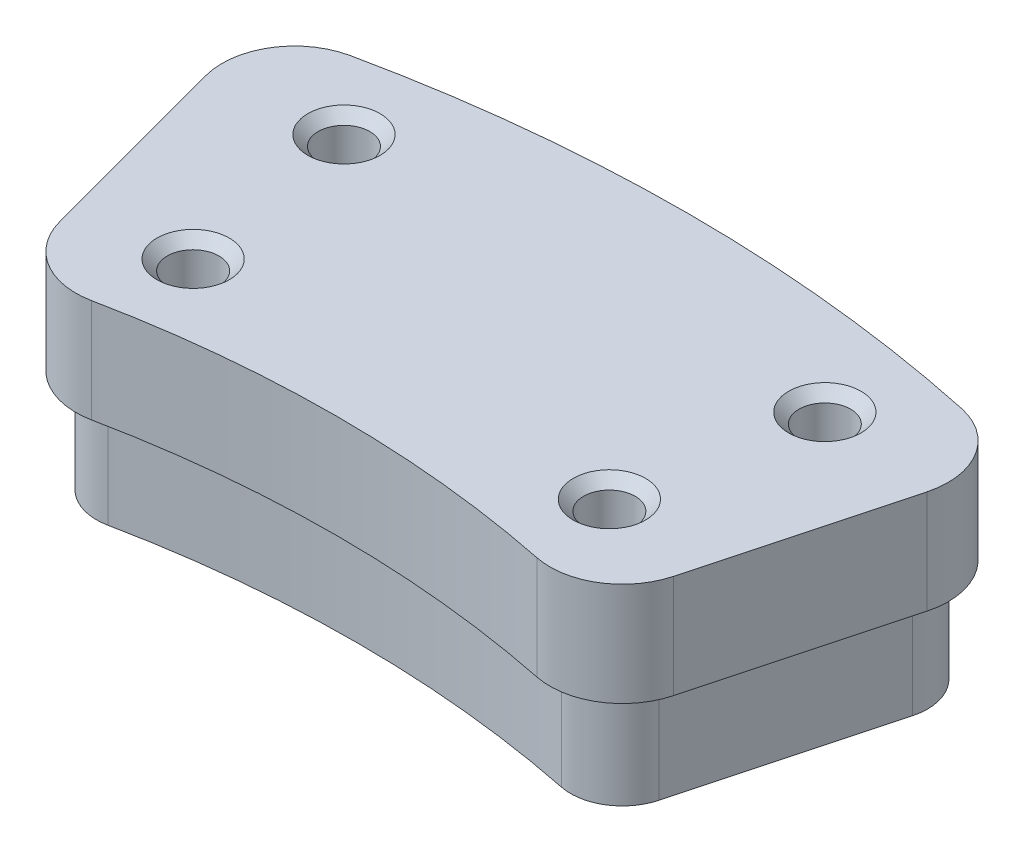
ISO-10303-21;
HEADER;
FILE_DESCRIPTION(('STEP AP214'),'2;1');
FILE_NAME('part.step','',(''),(''),'','','');
FILE_SCHEMA(('AUTOMOTIVE_DESIGN { 1 0 10303 214 1 1 1 1 }'));
ENDSEC;
DATA;
#1=APPLICATION_CONTEXT('core data for automotive mechanical design processes');
#2=APPLICATION_PROTOCOL_DEFINITION('international standard','automotive_design',2000,#1);
#3=PRODUCT_CONTEXT('',#1,'mechanical');
#4=PRODUCT('Part','Part','',(#3));
#5=PRODUCT_RELATED_PRODUCT_CATEGORY('part','',(#4));
#6=PRODUCT_DEFINITION_FORMATION('','',#4);
#7=PRODUCT_DEFINITION_CONTEXT('part definition',#1,'design');
#8=PRODUCT_DEFINITION('design','',#6,#7);
#9=PRODUCT_DEFINITION_SHAPE('','',#8);
#10=(LENGTH_UNIT() NAMED_UNIT(*) SI_UNIT(.MILLI.,.METRE.));
#11=(NAMED_UNIT(*) PLANE_ANGLE_UNIT() SI_UNIT($,.RADIAN.));
#12=(NAMED_UNIT(*) SI_UNIT($,.STERADIAN.) SOLID_ANGLE_UNIT());
#13=UNCERTAINTY_MEASURE_WITH_UNIT(LENGTH_MEASURE(1.E-05),#10,'distance_accuracy_value','');
#14=(GEOMETRIC_REPRESENTATION_CONTEXT(3) GLOBAL_UNCERTAINTY_ASSIGNED_CONTEXT((#13)) GLOBAL_UNIT_ASSIGNED_CONTEXT((#10,
#11,#12)) REPRESENTATION_CONTEXT('',''));
#15=CARTESIAN_POINT('',(0.,0.,0.));
#16=DIRECTION('',(0.,0.,1.));
#17=DIRECTION('',(1.,0.,0.));
#18=AXIS2_PLACEMENT_3D('',#15,#16,#17);
#19=CARTESIAN_POINT('',(0.,20.,0.));
#20=DIRECTION('',(0.,-1.,0.));
#21=DIRECTION('',(0.,0.,-1.));
#22=AXIS2_PLACEMENT_3D('',#19,#20,#21);
#23=CYLINDRICAL_SURFACE('',#22,108.);
#24=CARTESIAN_POINT('',(0.,20.,0.));
#25=DIRECTION('',(0.,-1.,0.));
#26=DIRECTION('',(0.,0.,1.));
#27=AXIS2_PLACEMENT_3D('',#24,#25,#26);
#28=CIRCLE('',#27,108.);
#29=CARTESIAN_POINT('',(-21.5507130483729,20.,-105.828005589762));
#30=VERTEX_POINT('',#29);
#31=CARTESIAN_POINT('',(21.5507130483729,20.,-105.828005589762));
#32=VERTEX_POINT('',#31);
#33=EDGE_CURVE('E238',#30,#32,#28,.T.);
#34=ORIENTED_EDGE('',*,*,#33,.F.);
#35=DIRECTION('',(0.,-1.,0.));
#36=VECTOR('',#35,1.);
#37=CARTESIAN_POINT('',(-21.550713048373,20.,-105.828005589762));
#38=LINE('',#37,#36);
#39=CARTESIAN_POINT('',(-21.5507130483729,10.,-105.828005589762));
#40=VERTEX_POINT('',#39);
#41=EDGE_CURVE('E278',#30,#40,#38,.T.);
#42=ORIENTED_EDGE('',*,*,#41,.T.);
#43=CARTESIAN_POINT('',(0.,10.,0.));
#44=DIRECTION('',(0.,1.,0.));
#45=DIRECTION('',(0.,0.,1.));
#46=AXIS2_PLACEMENT_3D('',#43,#44,#45);
#47=CIRCLE('',#46,108.);
#48=CARTESIAN_POINT('',(21.5507130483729,10.,-105.828005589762));
#49=VERTEX_POINT('',#48);
#50=EDGE_CURVE('E199',#40,#49,#47,.F.);
#51=ORIENTED_EDGE('',*,*,#50,.T.);
#52=DIRECTION('',(0.,-1.,0.));
#53=VECTOR('',#52,1.);
#54=CARTESIAN_POINT('',(21.550713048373,20.,-105.828005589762));
#55=LINE('',#54,#53);
#56=EDGE_CURVE('E276',#49,#32,#55,.F.);
#57=ORIENTED_EDGE('',*,*,#56,.T.);
#58=EDGE_LOOP('',(#34,#42,#51,#57));
#59=FACE_BOUND('',#58,.T.);
#60=ADVANCED_FACE('F38',(#59),#23,.F.);
#61=CARTESIAN_POINT('',(27.9524568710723,20.,-104.319989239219));
#62=DIRECTION('',(-0.965925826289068,0.,-0.258819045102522));
#63=DIRECTION('',(-0.258819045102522,0.,0.965925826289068));
#64=AXIS2_PLACEMENT_3D('',#61,#62,#63);
#65=PLANE('',#64);
#66=DIRECTION('',(0.258819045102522,0.,-0.965925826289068));
#67=VECTOR('',#66,1.);
#68=CARTESIAN_POINT('',(27.9524568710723,20.,-104.319989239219));
#69=LINE('',#68,#67);
#70=CARTESIAN_POINT('',(29.7089993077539,20.,-110.875494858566));
#71=VERTEX_POINT('',#70);
#72=CARTESIAN_POINT('',(34.8935686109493,20.,-130.224570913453));
#73=VERTEX_POINT('',#72);
#74=EDGE_CURVE('E241',#71,#73,#69,.T.);
#75=ORIENTED_EDGE('',*,*,#74,.F.);
#76=DIRECTION('',(0.,-1.,0.));
#77=VECTOR('',#76,1.);
#78=CARTESIAN_POINT('',(29.7089993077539,20.,-110.875494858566));
#79=LINE('',#78,#77);
#80=CARTESIAN_POINT('',(29.7089993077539,10.,-110.875494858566));
#81=VERTEX_POINT('',#80);
#82=EDGE_CURVE('E12',#71,#81,#79,.T.);
#83=ORIENTED_EDGE('',*,*,#82,.T.);
#84=DIRECTION('',(0.258819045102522,0.,-0.965925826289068));
#85=VECTOR('',#84,1.);
#86=CARTESIAN_POINT('',(27.9524568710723,10.,-104.319989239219));
#87=LINE('',#86,#85);
#88=CARTESIAN_POINT('',(34.8935686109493,10.,-130.224570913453));
#89=VERTEX_POINT('',#88);
#90=EDGE_CURVE('E196',#81,#89,#87,.T.);
#91=ORIENTED_EDGE('',*,*,#90,.T.);
#92=DIRECTION('',(0.,-1.,0.));
#93=VECTOR('',#92,1.);
#94=CARTESIAN_POINT('',(34.8935686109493,20.,-130.224570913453));
#95=LINE('',#94,#93);
#96=EDGE_CURVE('E46',#89,#73,#95,.F.);
#97=ORIENTED_EDGE('',*,*,#96,.T.);
#98=EDGE_LOOP('',(#75,#83,#91,#97));
#99=FACE_BOUND('',#98,.T.);
#100=ADVANCED_FACE('F307',(#99),#65,.F.);
#101=CARTESIAN_POINT('',(0.,20.,0.));
#102=DIRECTION('',(0.,-1.,0.));
#103=DIRECTION('',(0.,0.,-1.));
#104=AXIS2_PLACEMENT_3D('',#101,#102,#103);
#105=CYLINDRICAL_SURFACE('',#104,142.);
#106=CARTESIAN_POINT('',(0.,10.,0.));
#107=DIRECTION('',(0.,1.,0.));
#108=DIRECTION('',(0.,0.,1.));
#109=AXIS2_PLACEMENT_3D('',#106,#107,#108);
#110=CIRCLE('',#109,142.);
#111=CARTESIAN_POINT('',(29.5907886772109,10.,-138.882631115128));
#112=VERTEX_POINT('',#111);
#113=CARTESIAN_POINT('',(-29.5907886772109,10.,-138.882631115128));
#114=VERTEX_POINT('',#113);
#115=EDGE_CURVE('E194',#112,#114,#110,.T.);
#116=ORIENTED_EDGE('',*,*,#115,.T.);
#117=DIRECTION('',(0.,-1.,0.));
#118=VECTOR('',#117,1.);
#119=CARTESIAN_POINT('',(-29.5907886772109,20.,-138.882631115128));
#120=LINE('',#119,#118);
#121=CARTESIAN_POINT('',(-29.5907886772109,20.,-138.882631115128));
#122=VERTEX_POINT('',#121);
#123=EDGE_CURVE('E53',#114,#122,#120,.F.);
#124=ORIENTED_EDGE('',*,*,#123,.T.);
#125=CARTESIAN_POINT('',(0.,20.,0.));
#126=DIRECTION('',(0.,1.,0.));
#127=DIRECTION('',(0.,0.,1.));
#128=AXIS2_PLACEMENT_3D('',#125,#126,#127);
#129=CIRCLE('',#128,142.);
#130=CARTESIAN_POINT('',(29.5907886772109,20.,-138.882631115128));
#131=VERTEX_POINT('',#130);
#132=EDGE_CURVE('E243',#131,#122,#129,.T.);
#133=ORIENTED_EDGE('',*,*,#132,.F.);
#134=DIRECTION('',(0.,-1.,0.));
#135=VECTOR('',#134,1.);
#136=CARTESIAN_POINT('',(29.5907886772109,20.,-138.882631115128));
#137=LINE('',#136,#135);
#138=EDGE_CURVE('E301',#131,#112,#137,.T.);
#139=ORIENTED_EDGE('',*,*,#138,.T.);
#140=EDGE_LOOP('',(#116,#124,#133,#139));
#141=FACE_BOUND('',#140,.T.);
#142=ADVANCED_FACE('F315',(#141),#105,.T.);
#143=CARTESIAN_POINT('',(-27.9524568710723,20.,-104.319989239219));
#144=DIRECTION('',(0.965925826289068,0.,-0.258819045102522));
#145=DIRECTION('',(-0.258819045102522,0.,-0.965925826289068));
#146=AXIS2_PLACEMENT_3D('',#143,#144,#145);
#147=PLANE('',#146);
#148=DIRECTION('',(0.258819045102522,0.,0.965925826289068));
#149=VECTOR('',#148,1.);
#150=CARTESIAN_POINT('',(-27.9524568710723,10.,-104.319989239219));
#151=LINE('',#150,#149);
#152=CARTESIAN_POINT('',(-34.8935686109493,10.,-130.224570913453));
#153=VERTEX_POINT('',#152);
#154=CARTESIAN_POINT('',(-29.7089993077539,10.,-110.875494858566));
#155=VERTEX_POINT('',#154);
#156=EDGE_CURVE('E248',#153,#155,#151,.T.);
#157=ORIENTED_EDGE('',*,*,#156,.T.);
#158=DIRECTION('',(0.,-1.,0.));
#159=VECTOR('',#158,1.);
#160=CARTESIAN_POINT('',(-29.7089993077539,20.,-110.875494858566));
#161=LINE('',#160,#159);
#162=CARTESIAN_POINT('',(-29.7089993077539,20.,-110.875494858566));
#163=VERTEX_POINT('',#162);
#164=EDGE_CURVE('E292',#155,#163,#161,.F.);
#165=ORIENTED_EDGE('',*,*,#164,.T.);
#166=DIRECTION('',(0.258819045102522,0.,0.965925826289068));
#167=VECTOR('',#166,1.);
#168=CARTESIAN_POINT('',(-27.9524568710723,20.,-104.319989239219));
#169=LINE('',#168,#167);
#170=CARTESIAN_POINT('',(-34.8935686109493,20.,-130.224570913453));
#171=VERTEX_POINT('',#170);
#172=EDGE_CURVE('E245',#171,#163,#169,.T.);
#173=ORIENTED_EDGE('',*,*,#172,.F.);
#174=DIRECTION('',(0.,-1.,0.));
#175=VECTOR('',#174,1.);
#176=CARTESIAN_POINT('',(-34.8935686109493,20.,-130.224570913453));
#177=LINE('',#176,#175);
#178=EDGE_CURVE('E289',#171,#153,#177,.T.);
#179=ORIENTED_EDGE('',*,*,#178,.T.);
#180=EDGE_LOOP('',(#157,#165,#173,#179));
#181=FACE_BOUND('',#180,.T.);
#182=ADVANCED_FACE('F326',(#181),#147,.F.);
#183=CARTESIAN_POINT('',(0.,20.,0.));
#184=DIRECTION('',(0.,1.,0.));
#185=DIRECTION('',(0.,0.,1.));
#186=AXIS2_PLACEMENT_3D('',#183,#184,#185);
#187=PLANE('',#186);
#188=CARTESIAN_POINT('',(-20.143188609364,20.,-114.237699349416));
#189=DIRECTION('',(0.,1.,0.));
#190=DIRECTION('',(0.,0.,1.));
#191=AXIS2_PLACEMENT_3D('',#188,#189,#190);
#192=CIRCLE('',#191,3.5);
#193=CARTESIAN_POINT('',(-20.143188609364,20.,-110.737699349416));
#194=VERTEX_POINT('',#193);
#195=EDGE_CURVE('E202',#194,#194,#192,.T.);
#196=ORIENTED_EDGE('',*,*,#195,.F.);
#197=EDGE_LOOP('',(#196));
#198=FACE_BOUND('',#197,.T.);
#199=CARTESIAN_POINT('',(20.143188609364,20.,-114.237699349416));
#200=DIRECTION('',(0.,1.,0.));
#201=DIRECTION('',(0.,0.,1.));
#202=AXIS2_PLACEMENT_3D('',#199,#200,#201);
#203=CIRCLE('',#202,3.5);
#204=CARTESIAN_POINT('',(20.143188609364,20.,-110.737699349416));
#205=VERTEX_POINT('',#204);
#206=EDGE_CURVE('E211',#205,#205,#203,.T.);
#207=ORIENTED_EDGE('',*,*,#206,.F.);
#208=EDGE_LOOP('',(#207));
#209=FACE_BOUND('',#208,.T.);
#210=CARTESIAN_POINT('',(23.2688558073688,20.,-131.964238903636));
#211=DIRECTION('',(0.,1.,0.));
#212=DIRECTION('',(0.,0.,1.));
#213=AXIS2_PLACEMENT_3D('',#210,#211,#212);
#214=CIRCLE('',#213,3.5);
#215=CARTESIAN_POINT('',(23.2688558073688,20.,-128.464238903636));
#216=VERTEX_POINT('',#215);
#217=EDGE_CURVE('E220',#216,#216,#214,.T.);
#218=ORIENTED_EDGE('',*,*,#217,.F.);
#219=EDGE_LOOP('',(#218));
#220=FACE_BOUND('',#219,.T.);
#221=CARTESIAN_POINT('',(-23.2688558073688,20.,-131.964238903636));
#222=DIRECTION('',(0.,1.,0.));
#223=DIRECTION('',(0.,0.,1.));
#224=AXIS2_PLACEMENT_3D('',#221,#222,#223);
#225=CIRCLE('',#224,3.5);
#226=CARTESIAN_POINT('',(-23.2688558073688,20.,-128.464238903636));
#227=VERTEX_POINT('',#226);
#228=EDGE_CURVE('E229',#227,#227,#225,.T.);
#229=ORIENTED_EDGE('',*,*,#228,.F.);
#230=EDGE_LOOP('',(#229));
#231=FACE_BOUND('',#230,.T.);
#232=ORIENTED_EDGE('',*,*,#172,.T.);
#233=CARTESIAN_POINT('',(-22.9475185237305,20.,-112.687228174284));
#234=DIRECTION('',(0.,1.,0.));
#235=DIRECTION('',(0.,0.,1.));
#236=AXIS2_PLACEMENT_3D('',#233,#234,#235);
#237=CIRCLE('',#236,7.);
#238=EDGE_CURVE('E299',#163,#30,#237,.T.);
#239=ORIENTED_EDGE('',*,*,#238,.T.);
#240=ORIENTED_EDGE('',*,*,#33,.T.);
#241=CARTESIAN_POINT('',(22.9475185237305,20.,-112.687228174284));
#242=DIRECTION('',(0.,1.,0.));
#243=DIRECTION('',(0.,0.,1.));
#244=AXIS2_PLACEMENT_3D('',#241,#242,#243);
#245=CIRCLE('',#244,7.);
#246=EDGE_CURVE('E295',#32,#71,#245,.T.);
#247=ORIENTED_EDGE('',*,*,#246,.T.);
#248=ORIENTED_EDGE('',*,*,#74,.T.);
#249=CARTESIAN_POINT('',(28.1320878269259,20.,-132.036304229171));
#250=DIRECTION('',(0.,1.,0.));
#251=DIRECTION('',(0.,0.,1.));
#252=AXIS2_PLACEMENT_3D('',#249,#250,#251);
#253=CIRCLE('',#252,7.);
#254=EDGE_CURVE('E60',#73,#131,#253,.T.);
#255=ORIENTED_EDGE('',*,*,#254,.T.);
#256=ORIENTED_EDGE('',*,*,#132,.T.);
#257=CARTESIAN_POINT('',(-28.1320878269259,20.,-132.036304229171));
#258=DIRECTION('',(0.,1.,0.));
#259=DIRECTION('',(0.,0.,1.));
#260=AXIS2_PLACEMENT_3D('',#257,#258,#259);
#261=CIRCLE('',#260,7.);
#262=EDGE_CURVE('E297',#122,#171,#261,.T.);
#263=ORIENTED_EDGE('',*,*,#262,.T.);
#264=EDGE_LOOP('',(#232,#239,#240,#247,#248,#255,#256,#263));
#265=FACE_BOUND('',#264,.T.);
#266=ADVANCED_FACE('F311',(#198,#209,#220,#231,#265),#187,.T.);
#267=CARTESIAN_POINT('',(0.,0.,0.));
#268=DIRECTION('',(0.,1.,0.));
#269=DIRECTION('',(0.,0.,1.));
#270=AXIS2_PLACEMENT_3D('',#267,#268,#269);
#271=PLANE('',#270);
#272=CARTESIAN_POINT('',(0.,0.,0.));
#273=DIRECTION('',(0.,-1.,0.));
#274=DIRECTION('',(0.,0.,1.));
#275=AXIS2_PLACEMENT_3D('',#272,#273,#274);
#276=CIRCLE('',#275,110.);
#277=CARTESIAN_POINT('',(-21.9498003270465,0.,-107.787783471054));
#278=VERTEX_POINT('',#277);
#279=CARTESIAN_POINT('',(21.9498003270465,0.,-107.787783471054));
#280=VERTEX_POINT('',#279);
#281=EDGE_CURVE('E170',#278,#280,#276,.T.);
#282=ORIENTED_EDGE('',*,*,#281,.F.);
#283=CARTESIAN_POINT('',(-22.9475185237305,0.,-112.687228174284));
#284=DIRECTION('',(0.,1.,0.));
#285=DIRECTION('',(0.,0.,1.));
#286=AXIS2_PLACEMENT_3D('',#283,#284,#285);
#287=CIRCLE('',#286,5.);
#288=CARTESIAN_POINT('',(-27.7771476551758,0.,-111.393132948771));
#289=VERTEX_POINT('',#288);
#290=EDGE_CURVE('E153',#278,#289,#287,.F.);
#291=ORIENTED_EDGE('',*,*,#290,.T.);
#292=DIRECTION('',(0.258819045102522,0.,0.965925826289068));
#293=VECTOR('',#292,1.);
#294=CARTESIAN_POINT('',(-34.299117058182,0.,-135.7334541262));
#295=LINE('',#294,#293);
#296=CARTESIAN_POINT('',(-32.9617169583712,0.,-130.742209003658));
#297=VERTEX_POINT('',#296);
#298=EDGE_CURVE('E192',#297,#289,#295,.T.);
#299=ORIENTED_EDGE('',*,*,#298,.F.);
#300=CARTESIAN_POINT('',(-28.1320878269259,0.,-132.036304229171));
#301=DIRECTION('',(0.,1.,0.));
#302=DIRECTION('',(0.,0.,1.));
#303=AXIS2_PLACEMENT_3D('',#300,#301,#302);
#304=CIRCLE('',#303,5.);
#305=CARTESIAN_POINT('',(-29.1740170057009,0.,-136.92653771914));
#306=VERTEX_POINT('',#305);
#307=EDGE_CURVE('E164',#297,#306,#304,.F.);
#308=ORIENTED_EDGE('',*,*,#307,.T.);
#309=CARTESIAN_POINT('',(0.,0.,0.));
#310=DIRECTION('',(0.,1.,0.));
#311=DIRECTION('',(0.,0.,1.));
#312=AXIS2_PLACEMENT_3D('',#309,#310,#311);
#313=CIRCLE('',#312,140.);
#314=CARTESIAN_POINT('',(29.1740170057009,0.,-136.92653771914));
#315=VERTEX_POINT('',#314);
#316=EDGE_CURVE('E184',#315,#306,#313,.T.);
#317=ORIENTED_EDGE('',*,*,#316,.F.);
#318=CARTESIAN_POINT('',(28.1320878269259,0.,-132.036304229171));
#319=DIRECTION('',(0.,1.,0.));
#320=DIRECTION('',(0.,0.,1.));
#321=AXIS2_PLACEMENT_3D('',#318,#319,#320);
#322=CIRCLE('',#321,5.);
#323=CARTESIAN_POINT('',(32.9617169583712,0.,-130.742209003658));
#324=VERTEX_POINT('',#323);
#325=EDGE_CURVE('E174',#315,#324,#322,.F.);
#326=ORIENTED_EDGE('',*,*,#325,.T.);
#327=DIRECTION('',(0.258819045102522,0.,-0.965925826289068));
#328=VECTOR('',#327,1.);
#329=CARTESIAN_POINT('',(26.5335371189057,0.,-106.751915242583));
#330=LINE('',#329,#328);
#331=CARTESIAN_POINT('',(27.7771476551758,0.,-111.393132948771));
#332=VERTEX_POINT('',#331);
#333=EDGE_CURVE('E181',#332,#324,#330,.T.);
#334=ORIENTED_EDGE('',*,*,#333,.F.);
#335=CARTESIAN_POINT('',(22.9475185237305,0.,-112.687228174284));
#336=DIRECTION('',(0.,1.,0.));
#337=DIRECTION('',(0.,0.,1.));
#338=AXIS2_PLACEMENT_3D('',#335,#336,#337);
#339=CIRCLE('',#338,5.);
#340=EDGE_CURVE('E180',#332,#280,#339,.F.);
#341=ORIENTED_EDGE('',*,*,#340,.T.);
#342=EDGE_LOOP('',(#282,#291,#299,#308,#317,#326,#334,#341));
#343=FACE_BOUND('',#342,.T.);
#344=CARTESIAN_POINT('',(-20.143188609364,0.,-114.237699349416));
#345=DIRECTION('',(0.,1.,0.));
#346=DIRECTION('',(0.,0.,1.));
#347=AXIS2_PLACEMENT_3D('',#344,#345,#346);
#348=CIRCLE('',#347,2.5);
#349=CARTESIAN_POINT('',(-20.143188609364,0.,-111.737699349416));
#350=VERTEX_POINT('',#349);
#351=EDGE_CURVE('E208',#350,#350,#348,.T.);
#352=ORIENTED_EDGE('',*,*,#351,.T.);
#353=EDGE_LOOP('',(#352));
#354=FACE_BOUND('',#353,.T.);
#355=CARTESIAN_POINT('',(20.143188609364,0.,-114.237699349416));
#356=DIRECTION('',(0.,1.,0.));
#357=DIRECTION('',(0.,0.,1.));
#358=AXIS2_PLACEMENT_3D('',#355,#356,#357);
#359=CIRCLE('',#358,2.5);
#360=CARTESIAN_POINT('',(20.143188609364,0.,-111.737699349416));
#361=VERTEX_POINT('',#360);
#362=EDGE_CURVE('E217',#361,#361,#359,.T.);
#363=ORIENTED_EDGE('',*,*,#362,.T.);
#364=EDGE_LOOP('',(#363));
#365=FACE_BOUND('',#364,.T.);
#366=CARTESIAN_POINT('',(23.2688558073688,0.,-131.964238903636));
#367=DIRECTION('',(0.,1.,0.));
#368=DIRECTION('',(0.,0.,1.));
#369=AXIS2_PLACEMENT_3D('',#366,#367,#368);
#370=CIRCLE('',#369,2.5);
#371=CARTESIAN_POINT('',(23.2688558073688,0.,-129.464238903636));
#372=VERTEX_POINT('',#371);
#373=EDGE_CURVE('E226',#372,#372,#370,.T.);
#374=ORIENTED_EDGE('',*,*,#373,.T.);
#375=EDGE_LOOP('',(#374));
#376=FACE_BOUND('',#375,.T.);
#377=CARTESIAN_POINT('',(-23.2688558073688,0.,-131.964238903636));
#378=DIRECTION('',(0.,1.,0.));
#379=DIRECTION('',(0.,0.,1.));
#380=AXIS2_PLACEMENT_3D('',#377,#378,#379);
#381=CIRCLE('',#380,2.5);
#382=CARTESIAN_POINT('',(-23.2688558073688,0.,-129.464238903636));
#383=VERTEX_POINT('',#382);
#384=EDGE_CURVE('E235',#383,#383,#381,.T.);
#385=ORIENTED_EDGE('',*,*,#384,.T.);
#386=EDGE_LOOP('',(#385));
#387=FACE_BOUND('',#386,.T.);
#388=ADVANCED_FACE('F177',(#343,#354,#365,#376,#387),#271,.F.);
#389=CARTESIAN_POINT('',(-23.2688558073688,20.,-131.964238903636));
#390=DIRECTION('',(0.,1.,0.));
#391=DIRECTION('',(0.,0.,1.));
#392=AXIS2_PLACEMENT_3D('',#389,#390,#391);
#393=CYLINDRICAL_SURFACE('',#392,2.5);
#394=ORIENTED_EDGE('',*,*,#384,.F.);
#395=EDGE_LOOP('',(#394));
#396=FACE_BOUND('',#395,.T.);
#397=CARTESIAN_POINT('',(-23.2688558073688,19.,-131.964238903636));
#398=DIRECTION('',(0.,1.,0.));
#399=DIRECTION('',(0.,0.,1.));
#400=AXIS2_PLACEMENT_3D('',#397,#398,#399);
#401=CIRCLE('',#400,2.5);
#402=CARTESIAN_POINT('',(-23.2688558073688,19.,-129.464238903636));
#403=VERTEX_POINT('',#402);
#404=EDGE_CURVE('E232',#403,#403,#401,.T.);
#405=ORIENTED_EDGE('',*,*,#404,.T.);
#406=EDGE_LOOP('',(#405));
#407=FACE_BOUND('',#406,.T.);
#408=ADVANCED_FACE('F517',(#396,#407),#393,.F.);
#409=CARTESIAN_POINT('',(-23.2688558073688,20.,-131.964238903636));
#410=DIRECTION('',(0.,1.,0.));
#411=DIRECTION('',(0.,0.,1.));
#412=AXIS2_PLACEMENT_3D('',#409,#410,#411);
#413=CONICAL_SURFACE('',#412,3.5,0.785398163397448);
#414=ORIENTED_EDGE('',*,*,#404,.F.);
#415=EDGE_LOOP('',(#414));
#416=FACE_BOUND('',#415,.T.);
#417=ORIENTED_EDGE('',*,*,#228,.T.);
#418=EDGE_LOOP('',(#417));
#419=FACE_BOUND('',#418,.T.);
#420=ADVANCED_FACE('F507',(#416,#419),#413,.F.);
#421=CARTESIAN_POINT('',(23.2688558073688,20.,-131.964238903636));
#422=DIRECTION('',(0.,1.,0.));
#423=DIRECTION('',(0.,0.,1.));
#424=AXIS2_PLACEMENT_3D('',#421,#422,#423);
#425=CYLINDRICAL_SURFACE('',#424,2.5);
#426=ORIENTED_EDGE('',*,*,#373,.F.);
#427=EDGE_LOOP('',(#426));
#428=FACE_BOUND('',#427,.T.);
#429=CARTESIAN_POINT('',(23.2688558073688,19.,-131.964238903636));
#430=DIRECTION('',(0.,1.,0.));
#431=DIRECTION('',(0.,0.,1.));
#432=AXIS2_PLACEMENT_3D('',#429,#430,#431);
#433=CIRCLE('',#432,2.5);
#434=CARTESIAN_POINT('',(23.2688558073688,19.,-129.464238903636));
#435=VERTEX_POINT('',#434);
#436=EDGE_CURVE('E223',#435,#435,#433,.T.);
#437=ORIENTED_EDGE('',*,*,#436,.T.);
#438=EDGE_LOOP('',(#437));
#439=FACE_BOUND('',#438,.T.);
#440=ADVANCED_FACE('F498',(#428,#439),#425,.F.);
#441=CARTESIAN_POINT('',(23.2688558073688,20.,-131.964238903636));
#442=DIRECTION('',(0.,1.,0.));
#443=DIRECTION('',(0.,0.,1.));
#444=AXIS2_PLACEMENT_3D('',#441,#442,#443);
#445=CONICAL_SURFACE('',#444,3.5,0.785398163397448);
#446=ORIENTED_EDGE('',*,*,#436,.F.);
#447=EDGE_LOOP('',(#446));
#448=FACE_BOUND('',#447,.T.);
#449=ORIENTED_EDGE('',*,*,#217,.T.);
#450=EDGE_LOOP('',(#449));
#451=FACE_BOUND('',#450,.T.);
#452=ADVANCED_FACE('F488',(#448,#451),#445,.F.);
#453=CARTESIAN_POINT('',(20.143188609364,20.,-114.237699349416));
#454=DIRECTION('',(0.,1.,0.));
#455=DIRECTION('',(0.,0.,1.));
#456=AXIS2_PLACEMENT_3D('',#453,#454,#455);
#457=CYLINDRICAL_SURFACE('',#456,2.5);
#458=ORIENTED_EDGE('',*,*,#362,.F.);
#459=EDGE_LOOP('',(#458));
#460=FACE_BOUND('',#459,.T.);
#461=CARTESIAN_POINT('',(20.143188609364,19.,-114.237699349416));
#462=DIRECTION('',(0.,1.,0.));
#463=DIRECTION('',(0.,0.,1.));
#464=AXIS2_PLACEMENT_3D('',#461,#462,#463);
#465=CIRCLE('',#464,2.5);
#466=CARTESIAN_POINT('',(20.143188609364,19.,-111.737699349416));
#467=VERTEX_POINT('',#466);
#468=EDGE_CURVE('E214',#467,#467,#465,.T.);
#469=ORIENTED_EDGE('',*,*,#468,.T.);
#470=EDGE_LOOP('',(#469));
#471=FACE_BOUND('',#470,.T.);
#472=ADVANCED_FACE('F479',(#460,#471),#457,.F.);
#473=CARTESIAN_POINT('',(20.143188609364,20.,-114.237699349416));
#474=DIRECTION('',(0.,1.,0.));
#475=DIRECTION('',(0.,0.,1.));
#476=AXIS2_PLACEMENT_3D('',#473,#474,#475);
#477=CONICAL_SURFACE('',#476,3.5,0.785398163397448);
#478=ORIENTED_EDGE('',*,*,#468,.F.);
#479=EDGE_LOOP('',(#478));
#480=FACE_BOUND('',#479,.T.);
#481=ORIENTED_EDGE('',*,*,#206,.T.);
#482=EDGE_LOOP('',(#481));
#483=FACE_BOUND('',#482,.T.);
#484=ADVANCED_FACE('F469',(#480,#483),#477,.F.);
#485=CARTESIAN_POINT('',(-20.143188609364,20.,-114.237699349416));
#486=DIRECTION('',(0.,1.,0.));
#487=DIRECTION('',(0.,0.,1.));
#488=AXIS2_PLACEMENT_3D('',#485,#486,#487);
#489=CYLINDRICAL_SURFACE('',#488,2.5);
#490=ORIENTED_EDGE('',*,*,#351,.F.);
#491=EDGE_LOOP('',(#490));
#492=FACE_BOUND('',#491,.T.);
#493=CARTESIAN_POINT('',(-20.143188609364,19.,-114.237699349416));
#494=DIRECTION('',(0.,1.,0.));
#495=DIRECTION('',(0.,0.,1.));
#496=AXIS2_PLACEMENT_3D('',#493,#494,#495);
#497=CIRCLE('',#496,2.5);
#498=CARTESIAN_POINT('',(-20.143188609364,19.,-111.737699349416));
#499=VERTEX_POINT('',#498);
#500=EDGE_CURVE('E205',#499,#499,#497,.T.);
#501=ORIENTED_EDGE('',*,*,#500,.T.);
#502=EDGE_LOOP('',(#501));
#503=FACE_BOUND('',#502,.T.);
#504=ADVANCED_FACE('F460',(#492,#503),#489,.F.);
#505=CARTESIAN_POINT('',(-20.143188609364,20.,-114.237699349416));
#506=DIRECTION('',(0.,1.,0.));
#507=DIRECTION('',(0.,0.,1.));
#508=AXIS2_PLACEMENT_3D('',#505,#506,#507);
#509=CONICAL_SURFACE('',#508,3.5,0.785398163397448);
#510=ORIENTED_EDGE('',*,*,#500,.F.);
#511=EDGE_LOOP('',(#510));
#512=FACE_BOUND('',#511,.T.);
#513=ORIENTED_EDGE('',*,*,#195,.T.);
#514=EDGE_LOOP('',(#513));
#515=FACE_BOUND('',#514,.T.);
#516=ADVANCED_FACE('F450',(#512,#515),#509,.F.);
#517=CARTESIAN_POINT('',(0.,10.,-123.15999461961));
#518=DIRECTION('',(0.,1.,0.));
#519=DIRECTION('',(0.,0.,1.));
#520=AXIS2_PLACEMENT_3D('',#517,#518,#519);
#521=PLANE('',#520);
#522=CARTESIAN_POINT('',(0.,10.,0.));
#523=DIRECTION('',(0.,-1.,0.));
#524=DIRECTION('',(0.,0.,1.));
#525=AXIS2_PLACEMENT_3D('',#522,#523,#524);
#526=CIRCLE('',#525,110.);
#527=CARTESIAN_POINT('',(-21.9498003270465,10.,-107.787783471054));
#528=VERTEX_POINT('',#527);
#529=CARTESIAN_POINT('',(21.9498003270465,10.,-107.787783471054));
#530=VERTEX_POINT('',#529);
#531=EDGE_CURVE('E173',#528,#530,#526,.T.);
#532=ORIENTED_EDGE('',*,*,#531,.T.);
#533=CARTESIAN_POINT('',(22.9475185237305,10.,-112.687228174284));
#534=DIRECTION('',(0.,1.,0.));
#535=DIRECTION('',(0.,0.,1.));
#536=AXIS2_PLACEMENT_3D('',#533,#534,#535);
#537=CIRCLE('',#536,5.);
#538=CARTESIAN_POINT('',(27.7771476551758,10.,-111.393132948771));
#539=VERTEX_POINT('',#538);
#540=EDGE_CURVE('E272',#530,#539,#537,.T.);
#541=ORIENTED_EDGE('',*,*,#540,.T.);
#542=DIRECTION('',(0.258819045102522,0.,-0.965925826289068));
#543=VECTOR('',#542,1.);
#544=CARTESIAN_POINT('',(26.5335371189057,10.,-106.751915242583));
#545=LINE('',#544,#543);
#546=CARTESIAN_POINT('',(32.9617169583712,10.,-130.742209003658));
#547=VERTEX_POINT('',#546);
#548=EDGE_CURVE('E619',#539,#547,#545,.T.);
#549=ORIENTED_EDGE('',*,*,#548,.T.);
#550=CARTESIAN_POINT('',(28.1320878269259,10.,-132.036304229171));
#551=DIRECTION('',(0.,1.,0.));
#552=DIRECTION('',(0.,0.,1.));
#553=AXIS2_PLACEMENT_3D('',#550,#551,#552);
#554=CIRCLE('',#553,5.);
#555=CARTESIAN_POINT('',(29.1740170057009,10.,-136.92653771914));
#556=VERTEX_POINT('',#555);
#557=EDGE_CURVE('E274',#547,#556,#554,.T.);
#558=ORIENTED_EDGE('',*,*,#557,.T.);
#559=CARTESIAN_POINT('',(0.,10.,0.));
#560=DIRECTION('',(0.,1.,0.));
#561=DIRECTION('',(0.,0.,1.));
#562=AXIS2_PLACEMENT_3D('',#559,#560,#561);
#563=CIRCLE('',#562,140.);
#564=CARTESIAN_POINT('',(-29.1740170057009,10.,-136.92653771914));
#565=VERTEX_POINT('',#564);
#566=EDGE_CURVE('E629',#556,#565,#563,.T.);
#567=ORIENTED_EDGE('',*,*,#566,.T.);
#568=CARTESIAN_POINT('',(-28.1320878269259,10.,-132.036304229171));
#569=DIRECTION('',(0.,1.,0.));
#570=DIRECTION('',(0.,0.,1.));
#571=AXIS2_PLACEMENT_3D('',#568,#569,#570);
#572=CIRCLE('',#571,5.);
#573=CARTESIAN_POINT('',(-32.9617169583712,10.,-130.742209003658));
#574=VERTEX_POINT('',#573);
#575=EDGE_CURVE('E270',#565,#574,#572,.T.);
#576=ORIENTED_EDGE('',*,*,#575,.T.);
#577=DIRECTION('',(0.258819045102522,0.,0.965925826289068));
#578=VECTOR('',#577,1.);
#579=CARTESIAN_POINT('',(-34.299117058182,10.,-135.7334541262));
#580=LINE('',#579,#578);
#581=CARTESIAN_POINT('',(-27.7771476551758,10.,-111.393132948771));
#582=VERTEX_POINT('',#581);
#583=EDGE_CURVE('E187',#574,#582,#580,.T.);
#584=ORIENTED_EDGE('',*,*,#583,.T.);
#585=CARTESIAN_POINT('',(-22.9475185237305,10.,-112.687228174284));
#586=DIRECTION('',(0.,1.,0.));
#587=DIRECTION('',(0.,0.,1.));
#588=AXIS2_PLACEMENT_3D('',#585,#586,#587);
#589=CIRCLE('',#588,5.);
#590=EDGE_CURVE('E268',#582,#528,#589,.T.);
#591=ORIENTED_EDGE('',*,*,#590,.T.);
#592=EDGE_LOOP('',(#532,#541,#549,#558,#567,#576,#584,#591));
#593=FACE_BOUND('',#592,.T.);
#594=ORIENTED_EDGE('',*,*,#50,.F.);
#595=CARTESIAN_POINT('',(-22.9475185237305,10.,-112.687228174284));
#596=DIRECTION('',(0.,1.,0.));
#597=DIRECTION('',(0.,0.,1.));
#598=AXIS2_PLACEMENT_3D('',#595,#596,#597);
#599=CIRCLE('',#598,7.);
#600=EDGE_CURVE('E287',#40,#155,#599,.F.);
#601=ORIENTED_EDGE('',*,*,#600,.T.);
#602=ORIENTED_EDGE('',*,*,#156,.F.);
#603=CARTESIAN_POINT('',(-28.1320878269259,10.,-132.036304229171));
#604=DIRECTION('',(0.,1.,0.));
#605=DIRECTION('',(0.,0.,1.));
#606=AXIS2_PLACEMENT_3D('',#603,#604,#605);
#607=CIRCLE('',#606,7.);
#608=EDGE_CURVE('E285',#153,#114,#607,.F.);
#609=ORIENTED_EDGE('',*,*,#608,.T.);
#610=ORIENTED_EDGE('',*,*,#115,.F.);
#611=CARTESIAN_POINT('',(28.1320878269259,10.,-132.036304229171));
#612=DIRECTION('',(0.,1.,0.));
#613=DIRECTION('',(0.,0.,1.));
#614=AXIS2_PLACEMENT_3D('',#611,#612,#613);
#615=CIRCLE('',#614,7.);
#616=EDGE_CURVE('E281',#112,#89,#615,.F.);
#617=ORIENTED_EDGE('',*,*,#616,.T.);
#618=ORIENTED_EDGE('',*,*,#90,.F.);
#619=CARTESIAN_POINT('',(22.9475185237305,10.,-112.687228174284));
#620=DIRECTION('',(0.,1.,0.));
#621=DIRECTION('',(0.,0.,1.));
#622=AXIS2_PLACEMENT_3D('',#619,#620,#621);
#623=CIRCLE('',#622,7.);
#624=EDGE_CURVE('E283',#81,#49,#623,.F.);
#625=ORIENTED_EDGE('',*,*,#624,.T.);
#626=EDGE_LOOP('',(#594,#601,#602,#609,#610,#617,#618,#625));
#627=FACE_BOUND('',#626,.T.);
#628=ADVANCED_FACE('F318',(#593,#627),#521,.F.);
#629=CARTESIAN_POINT('',(0.,10.,0.));
#630=DIRECTION('',(0.,-1.,0.));
#631=DIRECTION('',(0.,0.,-1.));
#632=AXIS2_PLACEMENT_3D('',#629,#630,#631);
#633=CYLINDRICAL_SURFACE('',#632,110.);
#634=ORIENTED_EDGE('',*,*,#531,.F.);
#635=DIRECTION('',(0.,-1.,0.));
#636=VECTOR('',#635,1.);
#637=CARTESIAN_POINT('',(-21.9498003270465,10.,-107.787783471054));
#638=LINE('',#637,#636);
#639=EDGE_CURVE('E157',#528,#278,#638,.T.);
#640=ORIENTED_EDGE('',*,*,#639,.T.);
#641=ORIENTED_EDGE('',*,*,#281,.T.);
#642=DIRECTION('',(0.,-1.,0.));
#643=VECTOR('',#642,1.);
#644=CARTESIAN_POINT('',(21.9498003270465,10.,-107.787783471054));
#645=LINE('',#644,#643);
#646=EDGE_CURVE('E175',#280,#530,#645,.F.);
#647=ORIENTED_EDGE('',*,*,#646,.T.);
#648=EDGE_LOOP('',(#634,#640,#641,#647));
#649=FACE_BOUND('',#648,.T.);
#650=ADVANCED_FACE('F169',(#649),#633,.F.);
#651=CARTESIAN_POINT('',(26.5335371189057,10.,-106.751915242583));
#652=DIRECTION('',(-0.965925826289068,0.,-0.258819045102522));
#653=DIRECTION('',(-0.258819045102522,0.,0.965925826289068));
#654=AXIS2_PLACEMENT_3D('',#651,#652,#653);
#655=PLANE('',#654);
#656=ORIENTED_EDGE('',*,*,#548,.F.);
#657=DIRECTION('',(0.,-1.,0.));
#658=VECTOR('',#657,1.);
#659=CARTESIAN_POINT('',(27.7771476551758,10.,-111.393132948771));
#660=LINE('',#659,#658);
#661=EDGE_CURVE('E265',#539,#332,#660,.T.);
#662=ORIENTED_EDGE('',*,*,#661,.T.);
#663=ORIENTED_EDGE('',*,*,#333,.T.);
#664=DIRECTION('',(0.,-1.,0.));
#665=VECTOR('',#664,1.);
#666=CARTESIAN_POINT('',(32.9617169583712,10.,-130.742209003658));
#667=LINE('',#666,#665);
#668=EDGE_CURVE('E263',#324,#547,#667,.F.);
#669=ORIENTED_EDGE('',*,*,#668,.T.);
#670=EDGE_LOOP('',(#656,#662,#663,#669));
#671=FACE_BOUND('',#670,.T.);
#672=ADVANCED_FACE('F426',(#671),#655,.F.);
#673=CARTESIAN_POINT('',(0.,10.,0.));
#674=DIRECTION('',(0.,-1.,0.));
#675=DIRECTION('',(0.,0.,-1.));
#676=AXIS2_PLACEMENT_3D('',#673,#674,#675);
#677=CYLINDRICAL_SURFACE('',#676,140.);
#678=ORIENTED_EDGE('',*,*,#316,.T.);
#679=DIRECTION('',(0.,-1.,0.));
#680=VECTOR('',#679,1.);
#681=CARTESIAN_POINT('',(-29.1740170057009,10.,-136.92653771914));
#682=LINE('',#681,#680);
#683=EDGE_CURVE('E261',#306,#565,#682,.F.);
#684=ORIENTED_EDGE('',*,*,#683,.T.);
#685=ORIENTED_EDGE('',*,*,#566,.F.);
#686=DIRECTION('',(0.,-1.,0.));
#687=VECTOR('',#686,1.);
#688=CARTESIAN_POINT('',(29.1740170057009,10.,-136.92653771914));
#689=LINE('',#688,#687);
#690=EDGE_CURVE('E258',#556,#315,#689,.T.);
#691=ORIENTED_EDGE('',*,*,#690,.T.);
#692=EDGE_LOOP('',(#678,#684,#685,#691));
#693=FACE_BOUND('',#692,.T.);
#694=ADVANCED_FACE('F417',(#693),#677,.T.);
#695=CARTESIAN_POINT('',(-34.299117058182,10.,-135.7334541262));
#696=DIRECTION('',(0.965925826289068,0.,-0.258819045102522));
#697=DIRECTION('',(-0.258819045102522,0.,-0.965925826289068));
#698=AXIS2_PLACEMENT_3D('',#695,#696,#697);
#699=PLANE('',#698);
#700=ORIENTED_EDGE('',*,*,#298,.T.);
#701=DIRECTION('',(0.,-1.,0.));
#702=VECTOR('',#701,1.);
#703=CARTESIAN_POINT('',(-27.7771476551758,10.,-111.393132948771));
#704=LINE('',#703,#702);
#705=EDGE_CURVE('E158',#289,#582,#704,.F.);
#706=ORIENTED_EDGE('',*,*,#705,.T.);
#707=ORIENTED_EDGE('',*,*,#583,.F.);
#708=DIRECTION('',(0.,-1.,0.));
#709=VECTOR('',#708,1.);
#710=CARTESIAN_POINT('',(-32.9617169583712,10.,-130.742209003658));
#711=LINE('',#710,#709);
#712=EDGE_CURVE('E163',#574,#297,#711,.T.);
#713=ORIENTED_EDGE('',*,*,#712,.T.);
#714=EDGE_LOOP('',(#700,#706,#707,#713));
#715=FACE_BOUND('',#714,.T.);
#716=ADVANCED_FACE('F354',(#715),#699,.F.);
#717=CARTESIAN_POINT('',(-22.9475185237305,10.,-112.687228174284));
#718=DIRECTION('',(0.,-1.,0.));
#719=DIRECTION('',(0.,0.,-1.));
#720=AXIS2_PLACEMENT_3D('',#717,#718,#719);
#721=CYLINDRICAL_SURFACE('',#720,5.);
#722=ORIENTED_EDGE('',*,*,#590,.F.);
#723=ORIENTED_EDGE('',*,*,#705,.F.);
#724=ORIENTED_EDGE('',*,*,#290,.F.);
#725=ORIENTED_EDGE('',*,*,#639,.F.);
#726=EDGE_LOOP('',(#722,#723,#724,#725));
#727=FACE_BOUND('',#726,.T.);
#728=ADVANCED_FACE('F156',(#727),#721,.T.);
#729=CARTESIAN_POINT('',(-28.1320878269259,10.,-132.036304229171));
#730=DIRECTION('',(0.,-1.,0.));
#731=DIRECTION('',(0.,0.,-1.));
#732=AXIS2_PLACEMENT_3D('',#729,#730,#731);
#733=CYLINDRICAL_SURFACE('',#732,5.);
#734=ORIENTED_EDGE('',*,*,#575,.F.);
#735=ORIENTED_EDGE('',*,*,#683,.F.);
#736=ORIENTED_EDGE('',*,*,#307,.F.);
#737=ORIENTED_EDGE('',*,*,#712,.F.);
#738=EDGE_LOOP('',(#734,#735,#736,#737));
#739=FACE_BOUND('',#738,.T.);
#740=ADVANCED_FACE('F353',(#739),#733,.T.);
#741=CARTESIAN_POINT('',(22.9475185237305,10.,-112.687228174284));
#742=DIRECTION('',(0.,-1.,0.));
#743=DIRECTION('',(0.,0.,-1.));
#744=AXIS2_PLACEMENT_3D('',#741,#742,#743);
#745=CYLINDRICAL_SURFACE('',#744,5.);
#746=ORIENTED_EDGE('',*,*,#540,.F.);
#747=ORIENTED_EDGE('',*,*,#646,.F.);
#748=ORIENTED_EDGE('',*,*,#340,.F.);
#749=ORIENTED_EDGE('',*,*,#661,.F.);
#750=EDGE_LOOP('',(#746,#747,#748,#749));
#751=FACE_BOUND('',#750,.T.);
#752=ADVANCED_FACE('F357',(#751),#745,.T.);
#753=CARTESIAN_POINT('',(28.1320878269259,10.,-132.036304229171));
#754=DIRECTION('',(0.,-1.,0.));
#755=DIRECTION('',(0.,0.,-1.));
#756=AXIS2_PLACEMENT_3D('',#753,#754,#755);
#757=CYLINDRICAL_SURFACE('',#756,5.);
#758=ORIENTED_EDGE('',*,*,#557,.F.);
#759=ORIENTED_EDGE('',*,*,#668,.F.);
#760=ORIENTED_EDGE('',*,*,#325,.F.);
#761=ORIENTED_EDGE('',*,*,#690,.F.);
#762=EDGE_LOOP('',(#758,#759,#760,#761));
#763=FACE_BOUND('',#762,.T.);
#764=ADVANCED_FACE('F361',(#763),#757,.T.);
#765=CARTESIAN_POINT('',(-22.9475185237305,20.,-112.687228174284));
#766=DIRECTION('',(0.,-1.,0.));
#767=DIRECTION('',(0.,0.,-1.));
#768=AXIS2_PLACEMENT_3D('',#765,#766,#767);
#769=CYLINDRICAL_SURFACE('',#768,7.);
#770=ORIENTED_EDGE('',*,*,#238,.F.);
#771=ORIENTED_EDGE('',*,*,#164,.F.);
#772=ORIENTED_EDGE('',*,*,#600,.F.);
#773=ORIENTED_EDGE('',*,*,#41,.F.);
#774=EDGE_LOOP('',(#770,#771,#772,#773));
#775=FACE_BOUND('',#774,.T.);
#776=ADVANCED_FACE('F332',(#775),#769,.T.);
#777=CARTESIAN_POINT('',(-28.1320878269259,20.,-132.036304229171));
#778=DIRECTION('',(0.,-1.,0.));
#779=DIRECTION('',(0.,0.,-1.));
#780=AXIS2_PLACEMENT_3D('',#777,#778,#779);
#781=CYLINDRICAL_SURFACE('',#780,7.);
#782=ORIENTED_EDGE('',*,*,#262,.F.);
#783=ORIENTED_EDGE('',*,*,#123,.F.);
#784=ORIENTED_EDGE('',*,*,#608,.F.);
#785=ORIENTED_EDGE('',*,*,#178,.F.);
#786=EDGE_LOOP('',(#782,#783,#784,#785));
#787=FACE_BOUND('',#786,.T.);
#788=ADVANCED_FACE('F323',(#787),#781,.T.);
#789=CARTESIAN_POINT('',(22.9475185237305,20.,-112.687228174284));
#790=DIRECTION('',(0.,-1.,0.));
#791=DIRECTION('',(0.,0.,-1.));
#792=AXIS2_PLACEMENT_3D('',#789,#790,#791);
#793=CYLINDRICAL_SURFACE('',#792,7.);
#794=ORIENTED_EDGE('',*,*,#246,.F.);
#795=ORIENTED_EDGE('',*,*,#56,.F.);
#796=ORIENTED_EDGE('',*,*,#624,.F.);
#797=ORIENTED_EDGE('',*,*,#82,.F.);
#798=EDGE_LOOP('',(#794,#795,#796,#797));
#799=FACE_BOUND('',#798,.T.);
#800=ADVANCED_FACE('F336',(#799),#793,.T.);
#801=CARTESIAN_POINT('',(28.1320878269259,20.,-132.036304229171));
#802=DIRECTION('',(0.,-1.,0.));
#803=DIRECTION('',(0.,0.,-1.));
#804=AXIS2_PLACEMENT_3D('',#801,#802,#803);
#805=CYLINDRICAL_SURFACE('',#804,7.);
#806=ORIENTED_EDGE('',*,*,#254,.F.);
#807=ORIENTED_EDGE('',*,*,#96,.F.);
#808=ORIENTED_EDGE('',*,*,#616,.F.);
#809=ORIENTED_EDGE('',*,*,#138,.F.);
#810=EDGE_LOOP('',(#806,#807,#808,#809));
#811=FACE_BOUND('',#810,.T.);
#812=ADVANCED_FACE('F40',(#811),#805,.T.);
#813=CLOSED_SHELL('',(#60,#100,#142,#182,#266,#388,#408,#420,#440,#452,#472,#484,#504,#516,#628,
#650,#672,#694,#716,#728,#740,#752,#764,#776,#788,#800,#812));
#814=MANIFOLD_SOLID_BREP('B2',#813);
#815=ADVANCED_BREP_SHAPE_REPRESENTATION('',(#18,#814),#14);
#816=SHAPE_DEFINITION_REPRESENTATION(#9,#815);
ENDSEC;
END-ISO-10303-21;
